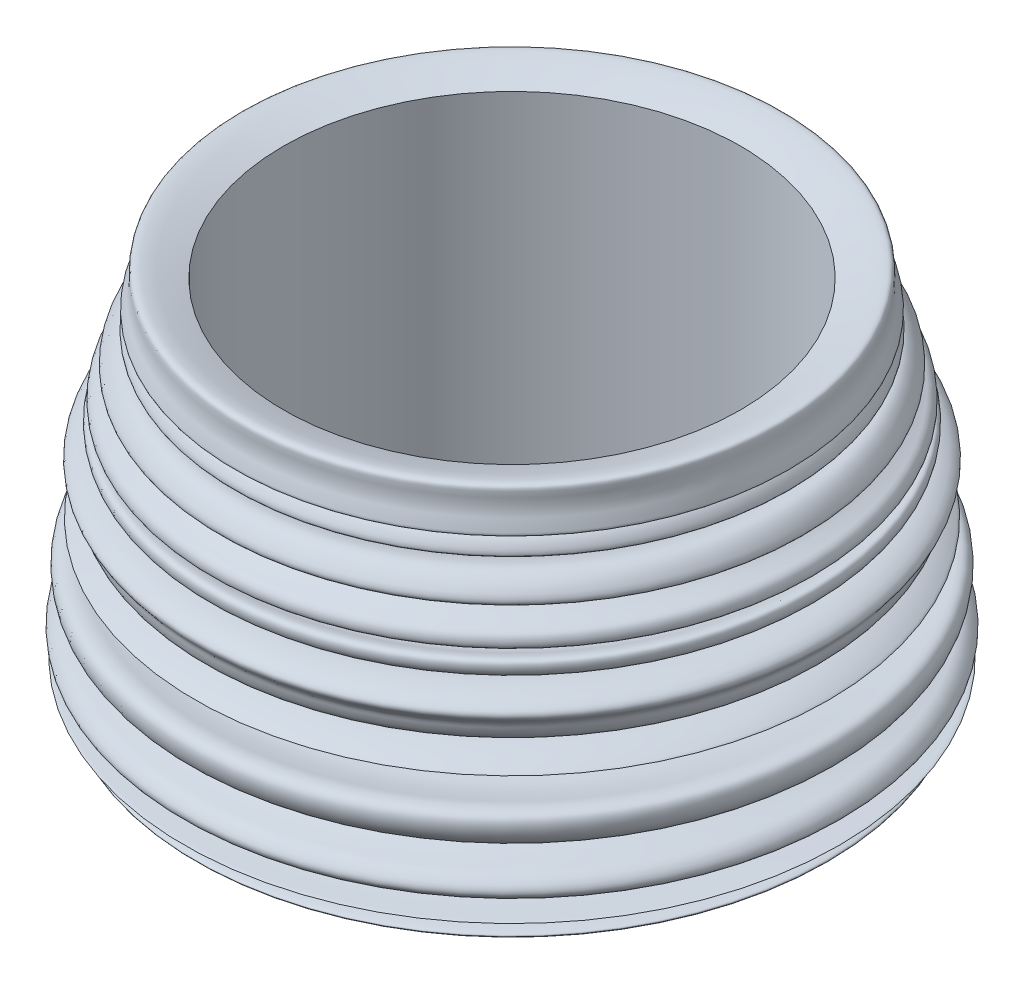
from build123d import *


with BuildPart() as part:
    # Sketch2 → Revolve2 (revolve)
    with BuildSketch(Plane.XY, mode=Mode.PRIVATE) as revolve2_sk:
        with BuildLine():
            Line((254, 203.2), (254, -203.2))
            add(Edge.make_bspline(
                [(254, 203.2), (317.868052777, 226.535574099), (289.113686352, 209.782839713), (319.583575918, 154.571841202), (252.556573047, 208.19344865), (280.969532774, 172.84276589), (299.634134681, 175.105388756), (312.781305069, 147.57790663), (286.086476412, 155.87185758), (266.169354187, 155.511947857), (263.029415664, 125.339461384), (299.794900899, 146.452207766), (317.541079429, 133.787532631), (328.451726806, 117.979912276), (312.888564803, 111.80107966), (303.682688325, 122.969180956), (287.74018605, 118.600653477), (266.85761714, 121.655788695), (266.402647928, 85.014128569), (281.985278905, 109.240948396), (301.457676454, 112.374885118), (315.390923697, 98.459445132), (332.609875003, 97.648509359), (336.543673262, 76.188891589), (311.847531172, 83.854915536), (293.905168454, 84.617473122), (272.119513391, 85.941551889), (258.569658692, 53.143054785), (294.468290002, 71.306717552), (311.620096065, 64.270468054), (337.440008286, 76.222026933), (337.347308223, 55.534595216), (315.591317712, 51.449975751), (294.84213929, 57.694223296), (272.988727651, 49.248507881), (257.561364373, 28.450366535), (288.090688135, 13.363998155), (283.406826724, 53.914223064), (371.024660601, 41.454605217), (344.464675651, 19.227632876), (344.332027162, 9.373962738), (338.504374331, -5.47746778), (321.599752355, 8.099297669), (304.508520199, -2.080867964), (286.787394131, -5.3234873), (272.75914863, 8.944829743), (263.657870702, -11.891979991), (293.182882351, -25.217864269), (310.700893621, -4.705864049), (371.866688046, -35.617592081), (323.942552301, -18.522038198), (345.70578065, -34.764505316), (323.597307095, -42.600998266), (319.013552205, -27.11253376), (300.203835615, -30.091439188), (278.116361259, -25.289691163), (266.921298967, -65.152725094), (308.408866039, -65.557883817), (334.350198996, -62.099356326), (359.937371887, -54.038131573), (364.360359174, -77.960564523), (353.168796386, -96.651352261), (333.018862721, -85.139188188), (315.056688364, -84.314120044), (296.700396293, -79.241950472), (265.138896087, -84.6601366), (290.930141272, -105.867373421), (314.763712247, -104.114267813), (335.183473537, -116.626494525), (357.331031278, -116.852774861), (371.552736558, -132.219281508), (344.801872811, -150.254129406), (318.663391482, -125.09657353), (283.168759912, -138.834023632), (254.29836606, -201.355487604), (303.825414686, -146.242672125), (330.122865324, -162.501229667), (395.026881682, -155.575786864), (292.862010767, -179.289172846), (375.371053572, -177.420666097), (314.19628913, -198.948779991), (286.664606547, -186.560116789), (265.952529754, -204.88248129), (254, -203.2)],
                knots=[0, 0, 0, 0, 0.034984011, 0.044326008, 0.069644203, 0.077286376, 0.095648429, 0.102275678, 0.113048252, 0.125362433, 0.130934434, 0.151864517, 0.161099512, 0.169383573, 0.174069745, 0.182192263, 0.189105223, 0.200022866, 0.211181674, 0.219525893, 0.230958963, 0.240912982, 0.250132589, 0.255443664, 0.267754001, 0.276417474, 0.289616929, 0.299801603, 0.313291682, 0.328983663, 0.338654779, 0.344808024, 0.352493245, 0.369858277, 0.380604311, 0.390675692, 0.402751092, 0.407863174, 0.443360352, 0.449334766, 0.45373982, 0.460185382, 0.469394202, 0.478305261, 0.491227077, 0.496998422, 0.50322603, 0.516153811, 0.532996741, 0.552192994, 0.561907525, 0.567881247, 0.575597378, 0.58212388, 0.588806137, 0.603318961, 0.614030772, 0.639045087, 0.645886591, 0.662192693, 0.669434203, 0.680700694, 0.688688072, 0.7025055, 0.71024119, 0.722779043, 0.735966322, 0.743247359, 0.764082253, 0.771323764, 0.780553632, 0.788142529, 0.812100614, 0.826899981, 0.849436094, 0.875119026, 0.885750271, 0.905209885, 0.92926467, 0.944559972, 0.965975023, 0.979499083, 1, 1, 1, 1], degree=3))
        make_face()
    revolve(revolve2_sk.sketch.rotate(Axis((0, 0, 0), (0, 1, 0)), 90), axis=Axis((0, 0, 0), (0, 1, 0)))


solid = part.part
